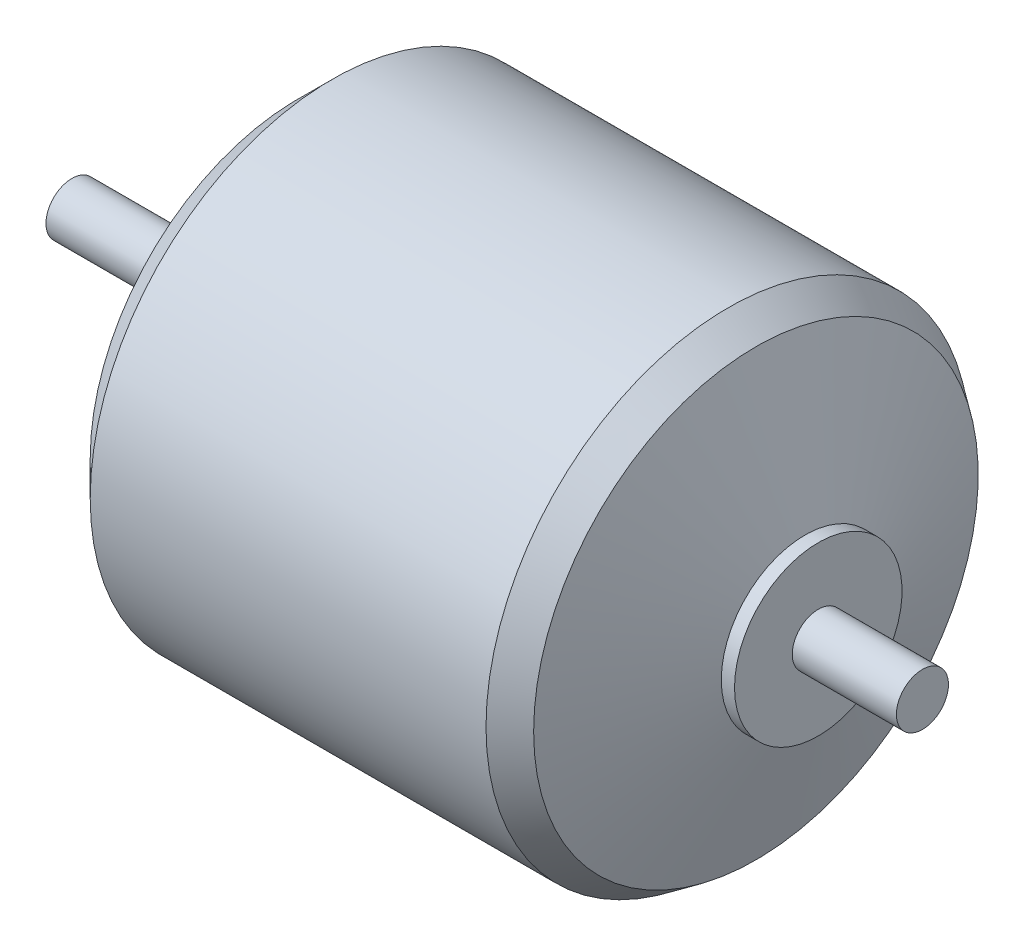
ISO-10303-21;
HEADER;
FILE_DESCRIPTION(('STEP AP214'),'2;1');
FILE_NAME('part.step','',(''),(''),'','','');
FILE_SCHEMA(('AUTOMOTIVE_DESIGN { 1 0 10303 214 1 1 1 1 }'));
ENDSEC;
DATA;
#1=APPLICATION_CONTEXT('core data for automotive mechanical design processes');
#2=APPLICATION_PROTOCOL_DEFINITION('international standard','automotive_design',2000,#1);
#3=PRODUCT_CONTEXT('',#1,'mechanical');
#4=PRODUCT('Part','Part','',(#3));
#5=PRODUCT_RELATED_PRODUCT_CATEGORY('part','',(#4));
#6=PRODUCT_DEFINITION_FORMATION('','',#4);
#7=PRODUCT_DEFINITION_CONTEXT('part definition',#1,'design');
#8=PRODUCT_DEFINITION('design','',#6,#7);
#9=PRODUCT_DEFINITION_SHAPE('','',#8);
#10=(LENGTH_UNIT() NAMED_UNIT(*) SI_UNIT(.MILLI.,.METRE.));
#11=(NAMED_UNIT(*) PLANE_ANGLE_UNIT() SI_UNIT($,.RADIAN.));
#12=(NAMED_UNIT(*) SI_UNIT($,.STERADIAN.) SOLID_ANGLE_UNIT());
#13=UNCERTAINTY_MEASURE_WITH_UNIT(LENGTH_MEASURE(1.E-05),#10,'distance_accuracy_value','');
#14=(GEOMETRIC_REPRESENTATION_CONTEXT(3) GLOBAL_UNCERTAINTY_ASSIGNED_CONTEXT((#13)) GLOBAL_UNIT_ASSIGNED_CONTEXT((#10,
#11,#12)) REPRESENTATION_CONTEXT('',''));
#15=CARTESIAN_POINT('',(0.,0.,0.));
#16=DIRECTION('',(0.,0.,1.));
#17=DIRECTION('',(1.,0.,0.));
#18=AXIS2_PLACEMENT_3D('',#15,#16,#17);
#19=CARTESIAN_POINT('',(30.,0.,0.));
#20=DIRECTION('',(1.,0.,0.));
#21=DIRECTION('',(0.,0.,-1.));
#22=AXIS2_PLACEMENT_3D('',#19,#20,#21);
#23=PLANE('',#22);
#24=CARTESIAN_POINT('',(30.,0.,0.));
#25=DIRECTION('',(1.,0.,0.));
#26=DIRECTION('',(0.,0.,-1.));
#27=AXIS2_PLACEMENT_3D('',#24,#25,#26);
#28=CIRCLE('',#27,1.5);
#29=CARTESIAN_POINT('',(30.,0.,-1.5));
#30=VERTEX_POINT('',#29);
#31=EDGE_CURVE('E47',#30,#30,#28,.T.);
#32=ORIENTED_EDGE('',*,*,#31,.F.);
#33=EDGE_LOOP('',(#32));
#34=FACE_BOUND('',#33,.T.);
#35=CARTESIAN_POINT('',(30.,0.,0.));
#36=DIRECTION('',(-1.,0.,0.));
#37=DIRECTION('',(0.,0.,1.));
#38=AXIS2_PLACEMENT_3D('',#35,#36,#37);
#39=CIRCLE('',#38,4.82643936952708);
#40=CARTESIAN_POINT('',(30.,0.,4.82643936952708));
#41=VERTEX_POINT('',#40);
#42=EDGE_CURVE('E80',#41,#41,#39,.T.);
#43=ORIENTED_EDGE('',*,*,#42,.F.);
#44=EDGE_LOOP('',(#43));
#45=FACE_BOUND('',#44,.T.);
#46=ADVANCED_FACE('F35',(#34,#45),#23,.T.);
#47=CARTESIAN_POINT('',(36.,0.,0.));
#48=DIRECTION('',(-1.,0.,0.));
#49=DIRECTION('',(0.,0.,1.));
#50=AXIS2_PLACEMENT_3D('',#47,#48,#49);
#51=CYLINDRICAL_SURFACE('',#50,1.5);
#52=CARTESIAN_POINT('',(36.,0.,0.));
#53=DIRECTION('',(1.,0.,0.));
#54=DIRECTION('',(0.,0.,-1.));
#55=AXIS2_PLACEMENT_3D('',#52,#53,#54);
#56=CIRCLE('',#55,1.5);
#57=CARTESIAN_POINT('',(36.,0.,-1.5));
#58=VERTEX_POINT('',#57);
#59=EDGE_CURVE('E43',#58,#58,#56,.T.);
#60=ORIENTED_EDGE('',*,*,#59,.F.);
#61=EDGE_LOOP('',(#60));
#62=FACE_BOUND('',#61,.T.);
#63=ORIENTED_EDGE('',*,*,#31,.T.);
#64=EDGE_LOOP('',(#63));
#65=FACE_BOUND('',#64,.T.);
#66=ADVANCED_FACE('F122',(#62,#65),#51,.T.);
#67=CARTESIAN_POINT('',(36.,0.,0.));
#68=DIRECTION('',(1.,0.,0.));
#69=DIRECTION('',(0.,0.,-1.));
#70=AXIS2_PLACEMENT_3D('',#67,#68,#69);
#71=PLANE('',#70);
#72=ORIENTED_EDGE('',*,*,#59,.T.);
#73=EDGE_LOOP('',(#72));
#74=FACE_BOUND('',#73,.T.);
#75=ADVANCED_FACE('F130',(#74),#71,.T.);
#76=CARTESIAN_POINT('',(-14.254748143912,0.,0.));
#77=DIRECTION('',(-1.,0.,0.));
#78=DIRECTION('',(0.,0.,1.));
#79=AXIS2_PLACEMENT_3D('',#76,#77,#78);
#80=CYLINDRICAL_SURFACE('',#79,4.82643936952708);
#81=ORIENTED_EDGE('',*,*,#42,.T.);
#82=EDGE_LOOP('',(#81));
#83=FACE_BOUND('',#82,.T.);
#84=CARTESIAN_POINT('',(29.2381189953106,0.,0.));
#85=DIRECTION('',(-1.,0.,0.));
#86=DIRECTION('',(0.,0.,1.));
#87=AXIS2_PLACEMENT_3D('',#84,#85,#86);
#88=CIRCLE('',#87,4.82643936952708);
#89=CARTESIAN_POINT('',(29.2381189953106,0.,4.82643936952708));
#90=VERTEX_POINT('',#89);
#91=EDGE_CURVE('E84',#90,#90,#88,.T.);
#92=ORIENTED_EDGE('',*,*,#91,.F.);
#93=EDGE_LOOP('',(#92));
#94=FACE_BOUND('',#93,.T.);
#95=ADVANCED_FACE('F178',(#83,#94),#80,.T.);
#96=CARTESIAN_POINT('',(26.4070709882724,0.,0.));
#97=DIRECTION('',(-1.,0.,0.));
#98=DIRECTION('',(0.,0.,1.));
#99=AXIS2_PLACEMENT_3D('',#96,#97,#98);
#100=CONICAL_SURFACE('',#99,12.807948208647,1.22993981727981);
#101=ORIENTED_EDGE('',*,*,#91,.T.);
#102=EDGE_LOOP('',(#101));
#103=FACE_BOUND('',#102,.T.);
#104=CARTESIAN_POINT('',(26.4070709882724,0.,0.));
#105=DIRECTION('',(-1.,0.,0.));
#106=DIRECTION('',(0.,0.,1.));
#107=AXIS2_PLACEMENT_3D('',#104,#105,#106);
#108=CIRCLE('',#107,12.807948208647);
#109=CARTESIAN_POINT('',(26.4070709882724,0.,12.807948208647));
#110=VERTEX_POINT('',#109);
#111=EDGE_CURVE('E87',#110,#110,#108,.T.);
#112=ORIENTED_EDGE('',*,*,#111,.F.);
#113=EDGE_LOOP('',(#112));
#114=FACE_BOUND('',#113,.T.);
#115=ADVANCED_FACE('F174',(#103,#114),#100,.T.);
#116=CARTESIAN_POINT('',(24.8039474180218,0.,0.));
#117=DIRECTION('',(-1.,0.,0.));
#118=DIRECTION('',(0.,0.,1.));
#119=AXIS2_PLACEMENT_3D('',#116,#117,#118);
#120=CONICAL_SURFACE('',#119,13.95,0.618994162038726);
#121=ORIENTED_EDGE('',*,*,#111,.T.);
#122=EDGE_LOOP('',(#121));
#123=FACE_BOUND('',#122,.T.);
#124=CARTESIAN_POINT('',(24.8039474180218,0.,0.));
#125=DIRECTION('',(-1.,0.,0.));
#126=DIRECTION('',(0.,0.,1.));
#127=AXIS2_PLACEMENT_3D('',#124,#125,#126);
#128=CIRCLE('',#127,13.95);
#129=CARTESIAN_POINT('',(24.8039474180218,0.,13.95));
#130=VERTEX_POINT('',#129);
#131=EDGE_CURVE('E90',#130,#130,#128,.T.);
#132=ORIENTED_EDGE('',*,*,#131,.F.);
#133=EDGE_LOOP('',(#132));
#134=FACE_BOUND('',#133,.T.);
#135=ADVANCED_FACE('F170',(#123,#134),#120,.T.);
#136=CARTESIAN_POINT('',(30.,0.,0.));
#137=DIRECTION('',(-1.,0.,0.));
#138=DIRECTION('',(0.,0.,1.));
#139=AXIS2_PLACEMENT_3D('',#136,#137,#138);
#140=CYLINDRICAL_SURFACE('',#139,13.95);
#141=ORIENTED_EDGE('',*,*,#131,.T.);
#142=EDGE_LOOP('',(#141));
#143=FACE_BOUND('',#142,.T.);
#144=CARTESIAN_POINT('',(2.,0.,0.));
#145=DIRECTION('',(-1.,0.,0.));
#146=DIRECTION('',(0.,0.,1.));
#147=AXIS2_PLACEMENT_3D('',#144,#145,#146);
#148=CIRCLE('',#147,13.95);
#149=CARTESIAN_POINT('',(2.,0.,13.95));
#150=VERTEX_POINT('',#149);
#151=EDGE_CURVE('E60',#150,#150,#148,.T.);
#152=ORIENTED_EDGE('',*,*,#151,.F.);
#153=EDGE_LOOP('',(#152));
#154=FACE_BOUND('',#153,.T.);
#155=ADVANCED_FACE('F37',(#143,#154),#140,.T.);
#156=CARTESIAN_POINT('',(0.,0.,0.));
#157=DIRECTION('',(1.,0.,0.));
#158=DIRECTION('',(0.,0.,-1.));
#159=AXIS2_PLACEMENT_3D('',#156,#157,#158);
#160=CONICAL_SURFACE('',#159,11.95,0.785398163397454);
#161=ORIENTED_EDGE('',*,*,#151,.T.);
#162=EDGE_LOOP('',(#161));
#163=FACE_BOUND('',#162,.T.);
#164=CARTESIAN_POINT('',(0.,0.,0.));
#165=DIRECTION('',(-1.,0.,0.));
#166=DIRECTION('',(0.,0.,1.));
#167=AXIS2_PLACEMENT_3D('',#164,#165,#166);
#168=CIRCLE('',#167,11.95);
#169=CARTESIAN_POINT('',(0.,0.,11.95));
#170=VERTEX_POINT('',#169);
#171=EDGE_CURVE('E83',#170,#170,#168,.T.);
#172=ORIENTED_EDGE('',*,*,#171,.F.);
#173=EDGE_LOOP('',(#172));
#174=FACE_BOUND('',#173,.T.);
#175=ADVANCED_FACE('F158',(#163,#174),#160,.T.);
#176=CARTESIAN_POINT('',(4.,0.,-9.5));
#177=DIRECTION('',(-1.,0.,0.));
#178=DIRECTION('',(0.,0.,1.));
#179=AXIS2_PLACEMENT_3D('',#176,#177,#178);
#180=PLANE('',#179);
#181=CARTESIAN_POINT('',(4.,0.,-9.5));
#182=DIRECTION('',(-1.,0.,0.));
#183=DIRECTION('',(0.,0.,1.));
#184=AXIS2_PLACEMENT_3D('',#181,#182,#183);
#185=CIRCLE('',#184,1.5);
#186=CARTESIAN_POINT('',(4.,0.,-8.));
#187=VERTEX_POINT('',#186);
#188=EDGE_CURVE('E55',#187,#187,#185,.T.);
#189=ORIENTED_EDGE('',*,*,#188,.T.);
#190=EDGE_LOOP('',(#189));
#191=FACE_BOUND('',#190,.T.);
#192=ADVANCED_FACE('F160',(#191),#180,.T.);
#193=CARTESIAN_POINT('',(4.,0.,9.5));
#194=DIRECTION('',(-1.,0.,0.));
#195=DIRECTION('',(0.,0.,1.));
#196=AXIS2_PLACEMENT_3D('',#193,#194,#195);
#197=PLANE('',#196);
#198=CARTESIAN_POINT('',(4.,0.,9.5));
#199=DIRECTION('',(-1.,0.,0.));
#200=DIRECTION('',(0.,0.,1.));
#201=AXIS2_PLACEMENT_3D('',#198,#199,#200);
#202=CIRCLE('',#201,1.5);
#203=CARTESIAN_POINT('',(4.,0.,11.));
#204=VERTEX_POINT('',#203);
#205=EDGE_CURVE('E72',#204,#204,#202,.T.);
#206=ORIENTED_EDGE('',*,*,#205,.T.);
#207=EDGE_LOOP('',(#206));
#208=FACE_BOUND('',#207,.T.);
#209=ADVANCED_FACE('F166',(#208),#197,.T.);
#210=CARTESIAN_POINT('',(4.,9.5,0.));
#211=DIRECTION('',(-1.,0.,0.));
#212=DIRECTION('',(0.,0.,1.));
#213=AXIS2_PLACEMENT_3D('',#210,#211,#212);
#214=PLANE('',#213);
#215=CARTESIAN_POINT('',(4.,9.5,0.));
#216=DIRECTION('',(-1.,0.,0.));
#217=DIRECTION('',(0.,0.,1.));
#218=AXIS2_PLACEMENT_3D('',#215,#216,#217);
#219=CIRCLE('',#218,1.5);
#220=CARTESIAN_POINT('',(4.,9.5,1.5));
#221=VERTEX_POINT('',#220);
#222=EDGE_CURVE('E66',#221,#221,#219,.T.);
#223=ORIENTED_EDGE('',*,*,#222,.T.);
#224=EDGE_LOOP('',(#223));
#225=FACE_BOUND('',#224,.T.);
#226=ADVANCED_FACE('F191',(#225),#214,.T.);
#227=CARTESIAN_POINT('',(4.,-9.5,0.));
#228=DIRECTION('',(-1.,0.,0.));
#229=DIRECTION('',(0.,0.,1.));
#230=AXIS2_PLACEMENT_3D('',#227,#228,#229);
#231=PLANE('',#230);
#232=CARTESIAN_POINT('',(4.,-9.5,0.));
#233=DIRECTION('',(-1.,0.,0.));
#234=DIRECTION('',(0.,0.,1.));
#235=AXIS2_PLACEMENT_3D('',#232,#233,#234);
#236=CIRCLE('',#235,1.5);
#237=CARTESIAN_POINT('',(4.,-9.5,1.5));
#238=VERTEX_POINT('',#237);
#239=EDGE_CURVE('E59',#238,#238,#236,.T.);
#240=ORIENTED_EDGE('',*,*,#239,.T.);
#241=EDGE_LOOP('',(#240));
#242=FACE_BOUND('',#241,.T.);
#243=ADVANCED_FACE('F187',(#242),#231,.T.);
#244=CARTESIAN_POINT('',(4.,0.,-9.5));
#245=DIRECTION('',(-1.,0.,0.));
#246=DIRECTION('',(0.,0.,1.));
#247=AXIS2_PLACEMENT_3D('',#244,#245,#246);
#248=CYLINDRICAL_SURFACE('',#247,1.5);
#249=ORIENTED_EDGE('',*,*,#188,.F.);
#250=EDGE_LOOP('',(#249));
#251=FACE_BOUND('',#250,.T.);
#252=CARTESIAN_POINT('',(0.,0.,-9.5));
#253=DIRECTION('',(-1.,0.,0.));
#254=DIRECTION('',(0.,0.,1.));
#255=AXIS2_PLACEMENT_3D('',#252,#253,#254);
#256=CIRCLE('',#255,1.5);
#257=CARTESIAN_POINT('',(0.,0.,-8.));
#258=VERTEX_POINT('',#257);
#259=EDGE_CURVE('E75',#258,#258,#256,.T.);
#260=ORIENTED_EDGE('',*,*,#259,.T.);
#261=EDGE_LOOP('',(#260));
#262=FACE_BOUND('',#261,.T.);
#263=ADVANCED_FACE('F183',(#251,#262),#248,.F.);
#264=CARTESIAN_POINT('',(4.,0.,9.5));
#265=DIRECTION('',(-1.,0.,0.));
#266=DIRECTION('',(0.,0.,1.));
#267=AXIS2_PLACEMENT_3D('',#264,#265,#266);
#268=CYLINDRICAL_SURFACE('',#267,1.5);
#269=ORIENTED_EDGE('',*,*,#205,.F.);
#270=EDGE_LOOP('',(#269));
#271=FACE_BOUND('',#270,.T.);
#272=CARTESIAN_POINT('',(0.,0.,9.5));
#273=DIRECTION('',(-1.,0.,0.));
#274=DIRECTION('',(0.,0.,1.));
#275=AXIS2_PLACEMENT_3D('',#272,#273,#274);
#276=CIRCLE('',#275,1.5);
#277=CARTESIAN_POINT('',(0.,0.,11.));
#278=VERTEX_POINT('',#277);
#279=EDGE_CURVE('E69',#278,#278,#276,.T.);
#280=ORIENTED_EDGE('',*,*,#279,.T.);
#281=EDGE_LOOP('',(#280));
#282=FACE_BOUND('',#281,.T.);
#283=ADVANCED_FACE('F186',(#271,#282),#268,.F.);
#284=CARTESIAN_POINT('',(4.,9.5,0.));
#285=DIRECTION('',(-1.,0.,0.));
#286=DIRECTION('',(0.,0.,1.));
#287=AXIS2_PLACEMENT_3D('',#284,#285,#286);
#288=CYLINDRICAL_SURFACE('',#287,1.5);
#289=ORIENTED_EDGE('',*,*,#222,.F.);
#290=EDGE_LOOP('',(#289));
#291=FACE_BOUND('',#290,.T.);
#292=CARTESIAN_POINT('',(0.,9.5,0.));
#293=DIRECTION('',(-1.,0.,0.));
#294=DIRECTION('',(0.,0.,1.));
#295=AXIS2_PLACEMENT_3D('',#292,#293,#294);
#296=CIRCLE('',#295,1.5);
#297=CARTESIAN_POINT('',(0.,9.5,1.5));
#298=VERTEX_POINT('',#297);
#299=EDGE_CURVE('E63',#298,#298,#296,.T.);
#300=ORIENTED_EDGE('',*,*,#299,.T.);
#301=EDGE_LOOP('',(#300));
#302=FACE_BOUND('',#301,.T.);
#303=ADVANCED_FACE('F144',(#291,#302),#288,.F.);
#304=CARTESIAN_POINT('',(4.,-9.5,0.));
#305=DIRECTION('',(-1.,0.,0.));
#306=DIRECTION('',(0.,0.,1.));
#307=AXIS2_PLACEMENT_3D('',#304,#305,#306);
#308=CYLINDRICAL_SURFACE('',#307,1.5);
#309=ORIENTED_EDGE('',*,*,#239,.F.);
#310=EDGE_LOOP('',(#309));
#311=FACE_BOUND('',#310,.T.);
#312=CARTESIAN_POINT('',(0.,-9.5,0.));
#313=DIRECTION('',(-1.,0.,0.));
#314=DIRECTION('',(0.,0.,1.));
#315=AXIS2_PLACEMENT_3D('',#312,#313,#314);
#316=CIRCLE('',#315,1.5);
#317=CARTESIAN_POINT('',(0.,-9.5,1.5));
#318=VERTEX_POINT('',#317);
#319=EDGE_CURVE('E56',#318,#318,#316,.T.);
#320=ORIENTED_EDGE('',*,*,#319,.T.);
#321=EDGE_LOOP('',(#320));
#322=FACE_BOUND('',#321,.T.);
#323=ADVANCED_FACE('F137',(#311,#322),#308,.F.);
#324=CARTESIAN_POINT('',(0.,0.,0.));
#325=DIRECTION('',(1.,0.,0.));
#326=DIRECTION('',(0.,0.,-1.));
#327=AXIS2_PLACEMENT_3D('',#324,#325,#326);
#328=PLANE('',#327);
#329=CARTESIAN_POINT('',(0.,0.,0.));
#330=DIRECTION('',(1.,0.,0.));
#331=DIRECTION('',(0.,0.,-1.));
#332=AXIS2_PLACEMENT_3D('',#329,#330,#331);
#333=CIRCLE('',#332,3.5);
#334=CARTESIAN_POINT('',(0.,0.,-3.5));
#335=VERTEX_POINT('',#334);
#336=EDGE_CURVE('E10',#335,#335,#333,.F.);
#337=ORIENTED_EDGE('',*,*,#336,.F.);
#338=EDGE_LOOP('',(#337));
#339=FACE_BOUND('',#338,.T.);
#340=ORIENTED_EDGE('',*,*,#319,.F.);
#341=EDGE_LOOP('',(#340));
#342=FACE_BOUND('',#341,.T.);
#343=ORIENTED_EDGE('',*,*,#299,.F.);
#344=EDGE_LOOP('',(#343));
#345=FACE_BOUND('',#344,.T.);
#346=ORIENTED_EDGE('',*,*,#279,.F.);
#347=EDGE_LOOP('',(#346));
#348=FACE_BOUND('',#347,.T.);
#349=ORIENTED_EDGE('',*,*,#259,.F.);
#350=EDGE_LOOP('',(#349));
#351=FACE_BOUND('',#350,.T.);
#352=ORIENTED_EDGE('',*,*,#171,.T.);
#353=EDGE_LOOP('',(#352));
#354=FACE_BOUND('',#353,.T.);
#355=ADVANCED_FACE('F118',(#339,#342,#345,#348,#351,#354),#328,.F.);
#356=CARTESIAN_POINT('',(-4.,0.,0.));
#357=DIRECTION('',(1.,0.,0.));
#358=DIRECTION('',(0.,0.,-1.));
#359=AXIS2_PLACEMENT_3D('',#356,#357,#358);
#360=CYLINDRICAL_SURFACE('',#359,3.5);
#361=CARTESIAN_POINT('',(-4.,0.,0.));
#362=DIRECTION('',(-1.,0.,0.));
#363=DIRECTION('',(0.,0.,1.));
#364=AXIS2_PLACEMENT_3D('',#361,#362,#363);
#365=CIRCLE('',#364,3.5);
#366=CARTESIAN_POINT('',(-4.,0.,3.5));
#367=VERTEX_POINT('',#366);
#368=EDGE_CURVE('E97',#367,#367,#365,.T.);
#369=ORIENTED_EDGE('',*,*,#368,.F.);
#370=EDGE_LOOP('',(#369));
#371=FACE_BOUND('',#370,.T.);
#372=ORIENTED_EDGE('',*,*,#336,.T.);
#373=EDGE_LOOP('',(#372));
#374=FACE_BOUND('',#373,.T.);
#375=ADVANCED_FACE('F110',(#371,#374),#360,.T.);
#376=CARTESIAN_POINT('',(-4.,0.,0.));
#377=DIRECTION('',(-1.,0.,0.));
#378=DIRECTION('',(0.,0.,1.));
#379=AXIS2_PLACEMENT_3D('',#376,#377,#378);
#380=PLANE('',#379);
#381=CARTESIAN_POINT('',(-4.,0.,0.));
#382=DIRECTION('',(-1.,0.,0.));
#383=DIRECTION('',(0.,0.,1.));
#384=AXIS2_PLACEMENT_3D('',#381,#382,#383);
#385=CIRCLE('',#384,1.5);
#386=CARTESIAN_POINT('',(-4.,0.,-1.5));
#387=VERTEX_POINT('',#386);
#388=EDGE_CURVE('E39',#387,#387,#385,.T.);
#389=ORIENTED_EDGE('',*,*,#388,.F.);
#390=EDGE_LOOP('',(#389));
#391=FACE_BOUND('',#390,.T.);
#392=ORIENTED_EDGE('',*,*,#368,.T.);
#393=EDGE_LOOP('',(#392));
#394=FACE_BOUND('',#393,.T.);
#395=ADVANCED_FACE('F107',(#391,#394),#380,.T.);
#396=CARTESIAN_POINT('',(-13.,0.,0.));
#397=DIRECTION('',(-1.,0.,0.));
#398=DIRECTION('',(0.,0.,1.));
#399=AXIS2_PLACEMENT_3D('',#396,#397,#398);
#400=PLANE('',#399);
#401=CARTESIAN_POINT('',(-13.,0.,0.));
#402=DIRECTION('',(-1.,0.,0.));
#403=DIRECTION('',(0.,0.,1.));
#404=AXIS2_PLACEMENT_3D('',#401,#402,#403);
#405=CIRCLE('',#404,1.5);
#406=CARTESIAN_POINT('',(-13.,0.,-1.5));
#407=VERTEX_POINT('',#406);
#408=EDGE_CURVE('E51',#407,#407,#405,.T.);
#409=ORIENTED_EDGE('',*,*,#408,.T.);
#410=EDGE_LOOP('',(#409));
#411=FACE_BOUND('',#410,.T.);
#412=ADVANCED_FACE('F109',(#411),#400,.T.);
#413=CARTESIAN_POINT('',(-13.,0.,0.));
#414=DIRECTION('',(1.,0.,0.));
#415=DIRECTION('',(0.,0.,-1.));
#416=AXIS2_PLACEMENT_3D('',#413,#414,#415);
#417=CYLINDRICAL_SURFACE('',#416,1.5);
#418=CARTESIAN_POINT('',(-4.,0.,-1.5));
#419=CARTESIAN_POINT('',(-4.09375,0.,-1.5));
#420=CARTESIAN_POINT('',(-4.1875,0.,-1.5));
#421=CARTESIAN_POINT('',(-4.375,0.,-1.5));
#422=CARTESIAN_POINT('',(-4.46875,0.,-1.5));
#423=CARTESIAN_POINT('',(-4.65625,0.,-1.5));
#424=CARTESIAN_POINT('',(-4.75,0.,-1.5));
#425=CARTESIAN_POINT('',(-4.9375,0.,-1.5));
#426=CARTESIAN_POINT('',(-5.03125,0.,-1.5));
#427=CARTESIAN_POINT('',(-5.21875,0.,-1.5));
#428=CARTESIAN_POINT('',(-5.3125,0.,-1.5));
#429=CARTESIAN_POINT('',(-5.5,0.,-1.5));
#430=CARTESIAN_POINT('',(-5.59375,0.,-1.5));
#431=CARTESIAN_POINT('',(-5.78125,0.,-1.5));
#432=CARTESIAN_POINT('',(-5.875,0.,-1.5));
#433=CARTESIAN_POINT('',(-6.0625,0.,-1.5));
#434=CARTESIAN_POINT('',(-6.15625,0.,-1.5));
#435=CARTESIAN_POINT('',(-6.34375,0.,-1.5));
#436=CARTESIAN_POINT('',(-6.4375,0.,-1.5));
#437=CARTESIAN_POINT('',(-6.625,0.,-1.5));
#438=CARTESIAN_POINT('',(-6.71875,0.,-1.5));
#439=CARTESIAN_POINT('',(-6.90625,0.,-1.5));
#440=CARTESIAN_POINT('',(-7.,0.,-1.5));
#441=CARTESIAN_POINT('',(-7.1875,0.,-1.5));
#442=CARTESIAN_POINT('',(-7.28125,0.,-1.5));
#443=CARTESIAN_POINT('',(-7.46875,0.,-1.5));
#444=CARTESIAN_POINT('',(-7.5625,0.,-1.5));
#445=CARTESIAN_POINT('',(-7.75,0.,-1.5));
#446=CARTESIAN_POINT('',(-7.84375,0.,-1.5));
#447=CARTESIAN_POINT('',(-8.03125,0.,-1.5));
#448=CARTESIAN_POINT('',(-8.125,0.,-1.5));
#449=CARTESIAN_POINT('',(-8.3125,0.,-1.5));
#450=CARTESIAN_POINT('',(-8.40625,0.,-1.5));
#451=CARTESIAN_POINT('',(-8.59375,0.,-1.5));
#452=CARTESIAN_POINT('',(-8.6875,0.,-1.5));
#453=CARTESIAN_POINT('',(-8.875,0.,-1.5));
#454=CARTESIAN_POINT('',(-8.96875,0.,-1.5));
#455=CARTESIAN_POINT('',(-9.15625,0.,-1.5));
#456=CARTESIAN_POINT('',(-9.25,0.,-1.5));
#457=CARTESIAN_POINT('',(-9.4375,0.,-1.5));
#458=CARTESIAN_POINT('',(-9.53125,0.,-1.5));
#459=CARTESIAN_POINT('',(-9.71875,0.,-1.5));
#460=CARTESIAN_POINT('',(-9.8125,0.,-1.5));
#461=CARTESIAN_POINT('',(-10.,0.,-1.5));
#462=CARTESIAN_POINT('',(-10.09375,0.,-1.5));
#463=CARTESIAN_POINT('',(-10.28125,0.,-1.5));
#464=CARTESIAN_POINT('',(-10.375,0.,-1.5));
#465=CARTESIAN_POINT('',(-10.5625,0.,-1.5));
#466=CARTESIAN_POINT('',(-10.65625,0.,-1.5));
#467=CARTESIAN_POINT('',(-10.84375,0.,-1.5));
#468=CARTESIAN_POINT('',(-10.9375,0.,-1.5));
#469=CARTESIAN_POINT('',(-11.125,0.,-1.5));
#470=CARTESIAN_POINT('',(-11.21875,0.,-1.5));
#471=CARTESIAN_POINT('',(-11.40625,0.,-1.5));
#472=CARTESIAN_POINT('',(-11.5,0.,-1.5));
#473=CARTESIAN_POINT('',(-11.6875,0.,-1.5));
#474=CARTESIAN_POINT('',(-11.78125,0.,-1.5));
#475=CARTESIAN_POINT('',(-11.96875,0.,-1.5));
#476=CARTESIAN_POINT('',(-12.0625,0.,-1.5));
#477=CARTESIAN_POINT('',(-12.25,0.,-1.5));
#478=CARTESIAN_POINT('',(-12.34375,0.,-1.5));
#479=CARTESIAN_POINT('',(-12.53125,0.,-1.5));
#480=CARTESIAN_POINT('',(-12.625,0.,-1.5));
#481=CARTESIAN_POINT('',(-12.8125,0.,-1.5));
#482=CARTESIAN_POINT('',(-12.90625,0.,-1.5));
#483=CARTESIAN_POINT('',(-13.,0.,-1.5));
#484=B_SPLINE_CURVE_WITH_KNOTS('',3,(#418,#419,#420,#421,#422,#423,#424,#425,#426,#427,#428,
#429,#430,#431,#432,#433,#434,#435,#436,#437,#438,#439,#440,#441,#442,#443,#444,#445,#446,#447,
#448,#449,#450,#451,#452,#453,#454,#455,#456,#457,#458,#459,#460,#461,#462,#463,#464,#465,#466,
#467,#468,#469,#470,#471,#472,#473,#474,#475,#476,#477,#478,#479,#480,#481,#482,#483),
.UNSPECIFIED.,.F.,.F.,(4,2,2,2,2,2,2,2,2,2,2,2,2,2,2,2,2,2,2,2,2,2,2,2,2,2,2,2,2,2,2,2,4),(0.,
0.28125,0.5625,0.843750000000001,1.125,1.40625,1.6875,1.96875,2.25,2.53125,2.8125,3.09375,3.375,
3.65625,3.9375,4.21875,4.5,4.78125,5.0625,5.34375,5.625,5.90625,6.1875,6.46875,6.75,7.03125,
7.3125,7.59375,7.875,8.15625,8.4375,8.71875,9.),.UNSPECIFIED.);
#485=EDGE_CURVE('BSEAM104',#387,#407,#484,.T.);
#486=ORIENTED_EDGE('',*,*,#388,.T.);
#487=ORIENTED_EDGE('',*,*,#408,.F.);
#488=ORIENTED_EDGE('',*,*,#485,.T.);
#489=ORIENTED_EDGE('',*,*,#485,.F.);
#490=EDGE_LOOP('',(#486,#488,#487,#489));
#491=FACE_BOUND('',#490,.T.);
#492=ADVANCED_FACE('F104',(#491),#417,.T.);
#493=CLOSED_SHELL('',(#46,#66,#75,#95,#115,#135,#155,#175,#192,#209,#226,#243,#263,#283,#303,
#323,#355,#375,#395,#412,#492));
#494=MANIFOLD_SOLID_BREP('B2',#493);
#495=ADVANCED_BREP_SHAPE_REPRESENTATION('',(#18,#494),#14);
#496=SHAPE_DEFINITION_REPRESENTATION(#9,#495);
ENDSEC;
END-ISO-10303-21;
